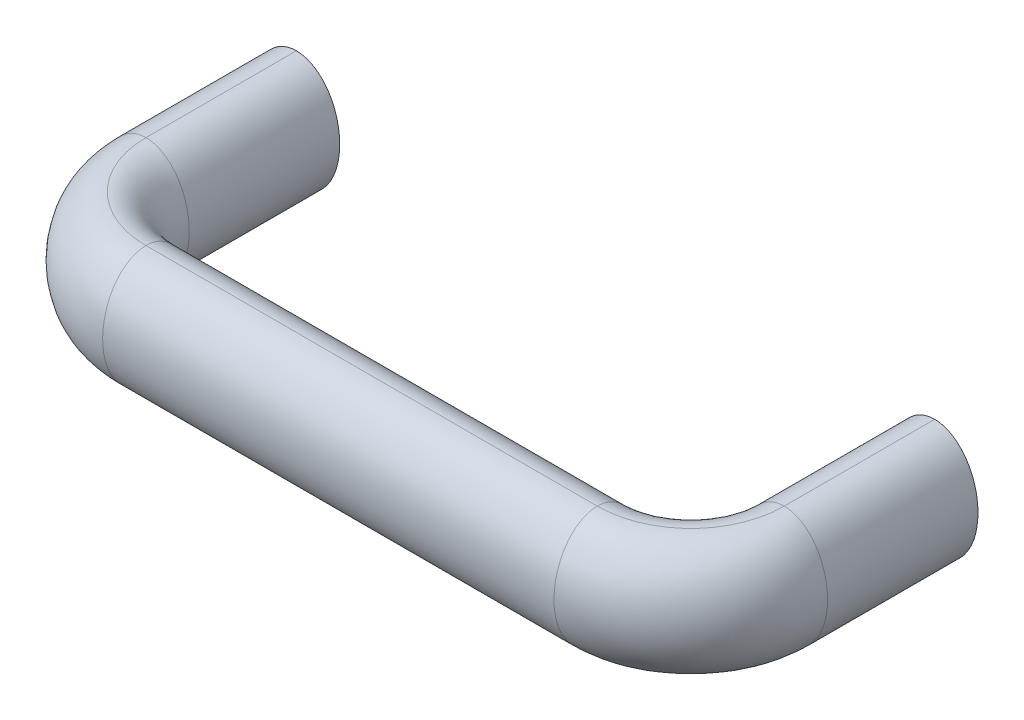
ISO-10303-21;
HEADER;
FILE_DESCRIPTION(('STEP AP214'),'2;1');
FILE_NAME('part.step','',(''),(''),'','','');
FILE_SCHEMA(('AUTOMOTIVE_DESIGN { 1 0 10303 214 1 1 1 1 }'));
ENDSEC;
DATA;
#1=APPLICATION_CONTEXT('core data for automotive mechanical design processes');
#2=APPLICATION_PROTOCOL_DEFINITION('international standard','automotive_design',2000,#1);
#3=PRODUCT_CONTEXT('',#1,'mechanical');
#4=PRODUCT('Part','Part','',(#3));
#5=PRODUCT_RELATED_PRODUCT_CATEGORY('part','',(#4));
#6=PRODUCT_DEFINITION_FORMATION('','',#4);
#7=PRODUCT_DEFINITION_CONTEXT('part definition',#1,'design');
#8=PRODUCT_DEFINITION('design','',#6,#7);
#9=PRODUCT_DEFINITION_SHAPE('','',#8);
#10=(LENGTH_UNIT() NAMED_UNIT(*) SI_UNIT(.MILLI.,.METRE.));
#11=(NAMED_UNIT(*) PLANE_ANGLE_UNIT() SI_UNIT($,.RADIAN.));
#12=(NAMED_UNIT(*) SI_UNIT($,.STERADIAN.) SOLID_ANGLE_UNIT());
#13=UNCERTAINTY_MEASURE_WITH_UNIT(LENGTH_MEASURE(1.E-05),#10,'distance_accuracy_value','');
#14=(GEOMETRIC_REPRESENTATION_CONTEXT(3) GLOBAL_UNCERTAINTY_ASSIGNED_CONTEXT((#13)) GLOBAL_UNIT_ASSIGNED_CONTEXT((#10,
#11,#12)) REPRESENTATION_CONTEXT('',''));
#15=CARTESIAN_POINT('',(0.,0.,0.));
#16=DIRECTION('',(0.,0.,1.));
#17=DIRECTION('',(1.,0.,0.));
#18=AXIS2_PLACEMENT_3D('',#15,#16,#17);
#19=CARTESIAN_POINT('',(0.,0.,0.));
#20=DIRECTION('',(0.,0.,-1.));
#21=DIRECTION('',(0.,1.,0.));
#22=AXIS2_PLACEMENT_3D('',#19,#20,#21);
#23=CONICAL_SURFACE('',#22,3.24999999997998,0.785398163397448);
#24=CARTESIAN_POINT('',(0.,0.,0.249999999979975));
#25=DIRECTION('',(0.,0.,-1.));
#26=DIRECTION('',(0.,1.,0.));
#27=AXIS2_PLACEMENT_3D('',#24,#25,#26);
#28=CIRCLE('',#27,3.);
#29=CARTESIAN_POINT('',(0.,3.,0.249999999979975));
#30=VERTEX_POINT('',#29);
#31=EDGE_CURVE('E316',#30,#30,#28,.F.);
#32=ORIENTED_EDGE('',*,*,#31,.T.);
#33=EDGE_LOOP('',(#32));
#34=FACE_BOUND('',#33,.T.);
#35=CARTESIAN_POINT('',(0.,0.,0.));
#36=DIRECTION('',(0.,0.,-1.));
#37=DIRECTION('',(0.,1.,0.));
#38=AXIS2_PLACEMENT_3D('',#35,#36,#37);
#39=CIRCLE('',#38,3.24999999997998);
#40=CARTESIAN_POINT('',(0.,3.24999999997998,0.));
#41=VERTEX_POINT('',#40);
#42=EDGE_CURVE('E72',#41,#41,#39,.T.);
#43=ORIENTED_EDGE('',*,*,#42,.T.);
#44=EDGE_LOOP('',(#43));
#45=FACE_BOUND('',#44,.T.);
#46=ADVANCED_FACE('F14',(#34,#45),#23,.F.);
#47=CARTESIAN_POINT('',(140.,0.,0.));
#48=DIRECTION('',(0.,0.,-1.));
#49=DIRECTION('',(0.,1.,0.));
#50=AXIS2_PLACEMENT_3D('',#47,#48,#49);
#51=CONICAL_SURFACE('',#50,3.24999999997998,0.785398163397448);
#52=CARTESIAN_POINT('',(140.,0.,0.249999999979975));
#53=DIRECTION('',(0.,0.,-1.));
#54=DIRECTION('',(0.,1.,0.));
#55=AXIS2_PLACEMENT_3D('',#52,#53,#54);
#56=CIRCLE('',#55,3.);
#57=CARTESIAN_POINT('',(140.,3.,0.249999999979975));
#58=VERTEX_POINT('',#57);
#59=EDGE_CURVE('E17',#58,#58,#56,.F.);
#60=ORIENTED_EDGE('',*,*,#59,.T.);
#61=EDGE_LOOP('',(#60));
#62=FACE_BOUND('',#61,.T.);
#63=CARTESIAN_POINT('',(140.,0.,0.));
#64=DIRECTION('',(0.,0.,-1.));
#65=DIRECTION('',(0.,1.,0.));
#66=AXIS2_PLACEMENT_3D('',#63,#64,#65);
#67=CIRCLE('',#66,3.24999999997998);
#68=CARTESIAN_POINT('',(140.,3.24999999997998,0.));
#69=VERTEX_POINT('',#68);
#70=EDGE_CURVE('E82',#69,#69,#67,.T.);
#71=ORIENTED_EDGE('',*,*,#70,.T.);
#72=EDGE_LOOP('',(#71));
#73=FACE_BOUND('',#72,.T.);
#74=ADVANCED_FACE('F155',(#62,#73),#51,.F.);
#75=CARTESIAN_POINT('',(0.,0.,0.));
#76=DIRECTION('',(0.,0.,1.));
#77=DIRECTION('',(0.,-1.,0.));
#78=AXIS2_PLACEMENT_3D('',#75,#76,#77);
#79=PLANE('',#78);
#80=ORIENTED_EDGE('',*,*,#42,.F.);
#81=EDGE_LOOP('',(#80));
#82=FACE_BOUND('',#81,.T.);
#83=CARTESIAN_POINT('',(0.,-13.,0.));
#84=CARTESIAN_POINT('',(-0.103704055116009,-13.0000016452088,0.));
#85=CARTESIAN_POINT('',(-0.207393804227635,-12.9976756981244,0.));
#86=CARTESIAN_POINT('',(-0.41456074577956,-12.9883904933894,0.));
#87=CARTESIAN_POINT('',(-0.518037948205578,-12.9814314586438,0.));
#88=CARTESIAN_POINT('',(-0.827720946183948,-12.9536523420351,0.));
#89=CARTESIAN_POINT('',(-1.03334827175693,-12.9259301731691,0.));
#90=CARTESIAN_POINT('',(-1.4398928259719,-12.8528518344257,0.));
#91=CARTESIAN_POINT('',(-1.64083313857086,-12.8076223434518,0.));
#92=CARTESIAN_POINT('',(-2.0381766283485,-12.7003072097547,0.));
#93=CARTESIAN_POINT('',(-2.23457932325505,-12.6382197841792,0.));
#94=CARTESIAN_POINT('',(-2.62116017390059,-12.4983673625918,0.));
#95=CARTESIAN_POINT('',(-2.8113522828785,-12.4206407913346,0.));
#96=CARTESIAN_POINT('',(-3.18513247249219,-12.2505210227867,0.));
#97=CARTESIAN_POINT('',(-3.36871782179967,-12.1581218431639,0.));
#98=CARTESIAN_POINT('',(-3.72876819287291,-11.9597195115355,0.));
#99=CARTESIAN_POINT('',(-3.90522073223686,-11.8536937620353,0.));
#100=CARTESIAN_POINT('',(-4.25016251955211,-11.6293733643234,0.));
#101=CARTESIAN_POINT('',(-4.41865007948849,-11.5110761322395,0.));
#102=CARTESIAN_POINT('',(-4.81454938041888,-11.2127044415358,0.));
#103=CARTESIAN_POINT('',(-5.03785689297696,-11.0271606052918,0.));
#104=CARTESIAN_POINT('',(-5.4673476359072,-10.6371825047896,0.));
#105=CARTESIAN_POINT('',(-5.6735241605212,-10.4327409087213,0.));
#106=CARTESIAN_POINT('',(-6.06866713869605,-10.0076838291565,0.));
#107=CARTESIAN_POINT('',(-6.25762379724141,-9.78705926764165,0.));
#108=CARTESIAN_POINT('',(-6.61826082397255,-9.33226558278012,0.));
#109=CARTESIAN_POINT('',(-6.78994500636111,-9.09809946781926,0.));
#110=CARTESIAN_POINT('',(-7.16996529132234,-8.5395199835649,0.));
#111=CARTESIAN_POINT('',(-7.37184591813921,-8.2107037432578,0.));
#112=CARTESIAN_POINT('',(-7.74637926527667,-7.53739509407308,0.));
#113=CARTESIAN_POINT('',(-7.91906165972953,-7.19291905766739,0.));
#114=CARTESIAN_POINT('',(-8.23777473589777,-6.48832470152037,0.));
#115=CARTESIAN_POINT('',(-8.38356346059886,-6.12809734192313,0.));
#116=CARTESIAN_POINT('',(-8.64757633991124,-5.39757283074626,0.));
#117=CARTESIAN_POINT('',(-8.76578993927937,-5.02727188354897,0.));
#118=CARTESIAN_POINT('',(-8.97563498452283,-4.27817663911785,0.));
#119=CARTESIAN_POINT('',(-9.06719481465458,-3.89936235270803,0.));
#120=CARTESIAN_POINT('',(-9.22392372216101,-3.13636922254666,0.));
#121=CARTESIAN_POINT('',(-9.28909437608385,-2.75219070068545,0.));
#122=CARTESIAN_POINT('',(-9.40169645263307,-1.91979237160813,0.));
#123=CARTESIAN_POINT('',(-9.44474471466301,-1.47097543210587,0.));
#124=CARTESIAN_POINT('',(-9.49655008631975,-0.571299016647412,0.));
#125=CARTESIAN_POINT('',(-9.50530008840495,-0.120439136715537,0.));
#126=CARTESIAN_POINT('',(-9.48859034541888,0.77973788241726,0.));
#127=CARTESIAN_POINT('',(-9.46320011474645,1.22905629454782,0.));
#128=CARTESIAN_POINT('',(-9.37811003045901,2.12428232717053,0.));
#129=CARTESIAN_POINT('',(-9.31842213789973,2.57019108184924,0.));
#130=CARTESIAN_POINT('',(-9.15762533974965,3.4937015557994,0.));
#131=CARTESIAN_POINT('',(-9.05342310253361,3.97077013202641,0.));
#132=CARTESIAN_POINT('',(-8.80270918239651,4.91433412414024,0.));
#133=CARTESIAN_POINT('',(-8.65615012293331,5.38081706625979,0.));
#134=CARTESIAN_POINT('',(-8.35114563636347,6.21100389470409,0.));
#135=CARTESIAN_POINT('',(-8.20018770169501,6.57746351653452,0.));
#136=CARTESIAN_POINT('',(-7.86847223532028,7.29687971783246,0.));
#137=CARTESIAN_POINT('',(-7.68770410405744,7.64983143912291,0.));
#138=CARTESIAN_POINT('',(-7.29558770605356,8.3379282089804,0.));
#139=CARTESIAN_POINT('',(-7.08427388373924,8.67309274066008,0.));
#140=CARTESIAN_POINT('',(-6.63011203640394,9.32128606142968,0.));
#141=CARTESIAN_POINT('',(-6.3872666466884,9.63431669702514,0.));
#142=CARTESIAN_POINT('',(-5.79567080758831,10.3176696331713,0.));
#143=CARTESIAN_POINT('',(-5.43639726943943,10.6791397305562,0.));
#144=CARTESIAN_POINT('',(-4.85877738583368,11.1754034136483,0.));
#145=CARTESIAN_POINT('',(-4.65983803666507,11.3331354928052,0.));
#146=CARTESIAN_POINT('',(-4.24934295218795,11.6313384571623,0.));
#147=CARTESIAN_POINT('',(-4.03778925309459,11.7718121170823,0.));
#148=CARTESIAN_POINT('',(-3.6372783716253,12.0125400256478,0.));
#149=CARTESIAN_POINT('',(-3.45002924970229,12.1156424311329,0.));
#150=CARTESIAN_POINT('',(-3.06792288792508,12.3066022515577,0.));
#151=CARTESIAN_POINT('',(-2.87306710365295,12.3944625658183,0.));
#152=CARTESIAN_POINT('',(-2.47696779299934,12.5535130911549,0.));
#153=CARTESIAN_POINT('',(-2.27573388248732,12.6247271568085,0.));
#154=CARTESIAN_POINT('',(-1.86792463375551,12.7494337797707,0.));
#155=CARTESIAN_POINT('',(-1.66135116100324,12.8029324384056,0.));
#156=CARTESIAN_POINT('',(-1.2142278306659,12.8976013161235,0.));
#157=CARTESIAN_POINT('',(-0.9730556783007,12.9359012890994,0.));
#158=CARTESIAN_POINT('',(-0.609314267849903,12.9743043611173,0.));
#159=CARTESIAN_POINT('',(-0.487680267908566,12.9839309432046,0.));
#160=CARTESIAN_POINT('',(-0.244039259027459,12.9967810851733,0.));
#161=CARTESIAN_POINT('',(-0.122032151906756,13.0000027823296,0.));
#162=CARTESIAN_POINT('',(0.,13.,0.));
#163=B_SPLINE_CURVE_WITH_KNOTS('',3,(#83,#84,#85,#86,#87,#88,#89,#90,#91,#92,#93,#94,#95,#96,
#97,#98,#99,#100,#101,#102,#103,#104,#105,#106,#107,#108,#109,#110,#111,#112,#113,#114,#115,
#116,#117,#118,#119,#120,#121,#122,#123,#124,#125,#126,#127,#128,#129,#130,#131,#132,#133,#134,
#135,#136,#137,#138,#139,#140,#141,#142,#143,#144,#145,#146,#147,#148,#149,#150,#151,#152,#153,
#154,#155,#156,#157,#158,#159,#160,#161,#162),.UNSPECIFIED.,.F.,.F.,(4,2,2,2,2,2,2,2,2,2,2,2,2,
2,2,2,2,2,2,2,2,2,2,2,2,2,2,2,2,2,2,2,2,2,2,2,2,2,2,4),(0.,0.311057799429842,0.622100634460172,
1.24367772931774,1.8608388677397,2.47806530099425,3.09379335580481,3.70977310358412,
4.32678786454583,4.94393280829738,5.81364209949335,6.68369024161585,7.55423023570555,
8.4245775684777,9.58047710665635,10.735194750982,11.8998422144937,13.0649347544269,
14.2331294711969,15.4012543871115,16.7525213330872,18.1040682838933,19.4528674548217,
20.8011965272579,22.2642970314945,23.7290404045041,24.9168225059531,26.1050278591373,
27.2919036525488,28.47868031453,30.0012695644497,30.76220027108,31.5230084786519,
32.163659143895,32.8041878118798,33.4437928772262,34.0831774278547,34.8143011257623,
35.1801993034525,35.5462038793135),.UNSPECIFIED.);
#164=CARTESIAN_POINT('',(0.,-13.,0.));
#165=VERTEX_POINT('',#164);
#166=CARTESIAN_POINT('',(0.,13.,0.));
#167=VERTEX_POINT('',#166);
#168=EDGE_CURVE('E64',#165,#167,#163,.T.);
#169=ORIENTED_EDGE('',*,*,#168,.T.);
#170=CARTESIAN_POINT('',(0.,13.,0.));
#171=CARTESIAN_POINT('',(0.10370405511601,13.0000016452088,0.));
#172=CARTESIAN_POINT('',(0.207393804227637,12.9976756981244,0.));
#173=CARTESIAN_POINT('',(0.414560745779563,12.9883904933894,0.));
#174=CARTESIAN_POINT('',(0.518037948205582,12.9814314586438,0.));
#175=CARTESIAN_POINT('',(0.827720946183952,12.9536523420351,0.));
#176=CARTESIAN_POINT('',(1.03334827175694,12.9259301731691,0.));
#177=CARTESIAN_POINT('',(1.4398928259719,12.8528518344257,0.));
#178=CARTESIAN_POINT('',(1.64083313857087,12.8076223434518,0.));
#179=CARTESIAN_POINT('',(2.03817662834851,12.7003072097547,0.));
#180=CARTESIAN_POINT('',(2.23457932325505,12.6382197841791,0.));
#181=CARTESIAN_POINT('',(2.62116017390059,12.4983673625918,0.));
#182=CARTESIAN_POINT('',(2.8113522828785,12.4206407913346,0.));
#183=CARTESIAN_POINT('',(3.1851324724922,12.2505210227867,0.));
#184=CARTESIAN_POINT('',(3.36871782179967,12.1581218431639,0.));
#185=CARTESIAN_POINT('',(3.72876819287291,11.9597195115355,0.));
#186=CARTESIAN_POINT('',(3.90522073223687,11.8536937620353,0.));
#187=CARTESIAN_POINT('',(4.25016251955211,11.6293733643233,0.));
#188=CARTESIAN_POINT('',(4.41865007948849,11.5110761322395,0.));
#189=CARTESIAN_POINT('',(4.81454938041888,11.2127044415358,0.));
#190=CARTESIAN_POINT('',(5.03785689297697,11.0271606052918,0.));
#191=CARTESIAN_POINT('',(5.46734763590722,10.6371825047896,0.));
#192=CARTESIAN_POINT('',(5.67352416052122,10.4327409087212,0.));
#193=CARTESIAN_POINT('',(6.06866713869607,10.0076838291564,0.));
#194=CARTESIAN_POINT('',(6.25762379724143,9.78705926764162,0.));
#195=CARTESIAN_POINT('',(6.61826082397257,9.33226558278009,0.));
#196=CARTESIAN_POINT('',(6.78994500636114,9.09809946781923,0.));
#197=CARTESIAN_POINT('',(7.16996529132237,8.53951998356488,0.));
#198=CARTESIAN_POINT('',(7.37184591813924,8.21070374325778,0.));
#199=CARTESIAN_POINT('',(7.74637926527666,7.53739509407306,0.));
#200=CARTESIAN_POINT('',(7.9190616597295,7.19291905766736,0.));
#201=CARTESIAN_POINT('',(8.23777473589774,6.48832470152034,0.));
#202=CARTESIAN_POINT('',(8.38356346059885,6.12809734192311,0.));
#203=CARTESIAN_POINT('',(8.64757633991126,5.39757283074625,0.));
#204=CARTESIAN_POINT('',(8.76578993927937,5.02727188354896,0.));
#205=CARTESIAN_POINT('',(8.97563498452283,4.27817663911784,0.));
#206=CARTESIAN_POINT('',(9.06719481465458,3.89936235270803,0.));
#207=CARTESIAN_POINT('',(9.223923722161,3.13636922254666,0.));
#208=CARTESIAN_POINT('',(9.28909437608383,2.75219070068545,0.));
#209=CARTESIAN_POINT('',(9.40169645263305,1.91979237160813,0.));
#210=CARTESIAN_POINT('',(9.444744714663,1.47097543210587,0.));
#211=CARTESIAN_POINT('',(9.49655008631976,0.571299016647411,0.));
#212=CARTESIAN_POINT('',(9.50530008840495,0.120439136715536,0.));
#213=CARTESIAN_POINT('',(9.48859034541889,-0.779737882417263,0.));
#214=CARTESIAN_POINT('',(9.46320011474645,-1.22905629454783,0.));
#215=CARTESIAN_POINT('',(9.378110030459,-2.12428232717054,0.));
#216=CARTESIAN_POINT('',(9.31842213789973,-2.57019108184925,0.));
#217=CARTESIAN_POINT('',(9.15762533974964,-3.49370155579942,0.));
#218=CARTESIAN_POINT('',(9.05342310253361,-3.97077013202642,0.));
#219=CARTESIAN_POINT('',(8.80270918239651,-4.91433412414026,0.));
#220=CARTESIAN_POINT('',(8.65615012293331,-5.38081706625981,0.));
#221=CARTESIAN_POINT('',(8.35114563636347,-6.21100389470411,0.));
#222=CARTESIAN_POINT('',(8.20018770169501,-6.57746351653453,0.));
#223=CARTESIAN_POINT('',(7.86847223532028,-7.29687971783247,0.));
#224=CARTESIAN_POINT('',(7.68770410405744,-7.64983143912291,0.));
#225=CARTESIAN_POINT('',(7.29558770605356,-8.33792820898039,0.));
#226=CARTESIAN_POINT('',(7.08427388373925,-8.67309274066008,0.));
#227=CARTESIAN_POINT('',(6.63011203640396,-9.32128606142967,0.));
#228=CARTESIAN_POINT('',(6.38726664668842,-9.63431669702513,0.));
#229=CARTESIAN_POINT('',(5.79567080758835,-10.3176696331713,0.));
#230=CARTESIAN_POINT('',(5.43639726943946,-10.6791397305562,0.));
#231=CARTESIAN_POINT('',(4.8587773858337,-11.1754034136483,0.));
#232=CARTESIAN_POINT('',(4.65983803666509,-11.3331354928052,0.));
#233=CARTESIAN_POINT('',(4.24934295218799,-11.6313384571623,0.));
#234=CARTESIAN_POINT('',(4.03778925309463,-11.7718121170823,0.));
#235=CARTESIAN_POINT('',(3.63727837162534,-12.0125400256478,0.));
#236=CARTESIAN_POINT('',(3.45002924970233,-12.1156424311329,0.));
#237=CARTESIAN_POINT('',(3.06792288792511,-12.3066022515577,0.));
#238=CARTESIAN_POINT('',(2.87306710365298,-12.3944625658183,0.));
#239=CARTESIAN_POINT('',(2.47696779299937,-12.5535130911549,0.));
#240=CARTESIAN_POINT('',(2.27573388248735,-12.6247271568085,0.));
#241=CARTESIAN_POINT('',(1.86792463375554,-12.7494337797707,0.));
#242=CARTESIAN_POINT('',(1.66135116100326,-12.8029324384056,0.));
#243=CARTESIAN_POINT('',(1.21422783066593,-12.8976013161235,0.));
#244=CARTESIAN_POINT('',(0.973055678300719,-12.9359012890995,0.));
#245=CARTESIAN_POINT('',(0.609314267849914,-12.9743043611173,0.));
#246=CARTESIAN_POINT('',(0.487680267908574,-12.9839309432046,0.));
#247=CARTESIAN_POINT('',(0.244039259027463,-12.9967810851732,0.));
#248=CARTESIAN_POINT('',(0.122032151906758,-13.0000027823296,0.));
#249=CARTESIAN_POINT('',(0.,-13.,0.));
#250=B_SPLINE_CURVE_WITH_KNOTS('',3,(#170,#171,#172,#173,#174,#175,#176,#177,#178,#179,#180,
#181,#182,#183,#184,#185,#186,#187,#188,#189,#190,#191,#192,#193,#194,#195,#196,#197,#198,#199,
#200,#201,#202,#203,#204,#205,#206,#207,#208,#209,#210,#211,#212,#213,#214,#215,#216,#217,#218,
#219,#220,#221,#222,#223,#224,#225,#226,#227,#228,#229,#230,#231,#232,#233,#234,#235,#236,#237,
#238,#239,#240,#241,#242,#243,#244,#245,#246,#247,#248,#249),.UNSPECIFIED.,.F.,.F.,(4,2,2,2,2,2,
2,2,2,2,2,2,2,2,2,2,2,2,2,2,2,2,2,2,2,2,2,2,2,2,2,2,2,2,2,2,2,2,2,4),(0.,0.311057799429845,
0.622100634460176,1.24367772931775,1.8608388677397,2.47806530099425,3.09379335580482,
3.70977310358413,4.32678786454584,4.94393280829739,5.81364209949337,6.68369024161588,
7.55423023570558,8.42457756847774,9.58047710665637,10.735194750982,11.8998422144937,
13.0649347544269,14.2331294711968,15.4012543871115,16.7525213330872,18.1040682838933,
19.4528674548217,20.8011965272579,22.2642970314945,23.7290404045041,24.9168225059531,
26.1050278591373,27.2919036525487,28.47868031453,30.0012695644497,30.7622002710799,
31.5230084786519,32.163659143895,32.8041878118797,33.4437928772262,34.0831774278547,
34.8143011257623,35.1801993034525,35.5462038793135),.UNSPECIFIED.);
#251=EDGE_CURVE('E66',#167,#165,#250,.T.);
#252=ORIENTED_EDGE('',*,*,#251,.T.);
#253=EDGE_LOOP('',(#169,#252));
#254=FACE_BOUND('',#253,.T.);
#255=ADVANCED_FACE('F68',(#82,#254),#79,.F.);
#256=CARTESIAN_POINT('',(0.,-13.,33.));
#257=CARTESIAN_POINT('',(0.,-13.,0.));
#258=CARTESIAN_POINT('',(19.,-13.,33.));
#259=CARTESIAN_POINT('',(19.,-13.,0.));
#260=CARTESIAN_POINT('',(19.,13.,33.));
#261=CARTESIAN_POINT('',(19.,13.,0.));
#262=CARTESIAN_POINT('',(0.,13.,33.));
#263=CARTESIAN_POINT('',(0.,13.,0.));
#264=(BOUNDED_SURFACE() B_SPLINE_SURFACE(3,1,((#256,#257),(#258,#259),(#260,#261),(#262,#263)),
.UNSPECIFIED.,.F.,.F.,.F.) B_SPLINE_SURFACE_WITH_KNOTS((4,4),(2,2),(0.,1.),(0.,1.),
.UNSPECIFIED.) GEOMETRIC_REPRESENTATION_ITEM() RATIONAL_B_SPLINE_SURFACE(((1.,1.),
(0.333333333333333,0.333333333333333),(0.333333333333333,0.333333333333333),(1.,1.))) REPRESENTATION_ITEM('') SURFACE());
#265=CARTESIAN_POINT('',(0.,-13.,33.));
#266=CARTESIAN_POINT('',(19.,-13.,33.));
#267=CARTESIAN_POINT('',(19.,13.,33.));
#268=CARTESIAN_POINT('',(0.,13.,33.));
#269=(BOUNDED_CURVE() B_SPLINE_CURVE(3,(#265,#266,#267,#268),.UNSPECIFIED.,.F.,
.F.) B_SPLINE_CURVE_WITH_KNOTS((4,4),(0.,1.),
.UNSPECIFIED.) CURVE() GEOMETRIC_REPRESENTATION_ITEM() RATIONAL_B_SPLINE_CURVE((1.,
0.333333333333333,0.333333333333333,1.)) REPRESENTATION_ITEM(''));
#270=CARTESIAN_POINT('',(0.,-13.,33.));
#271=VERTEX_POINT('',#270);
#272=CARTESIAN_POINT('',(0.,13.,33.));
#273=VERTEX_POINT('',#272);
#274=EDGE_CURVE('E78',#271,#273,#269,.T.);
#275=DIRECTION('',(0.,0.,-1.));
#276=VECTOR('',#275,1.);
#277=CARTESIAN_POINT('',(0.,-13.,16.5));
#278=LINE('',#277,#276);
#279=EDGE_CURVE('E75',#271,#165,#278,.T.);
#280=DIRECTION('',(0.,0.,1.));
#281=VECTOR('',#280,1.);
#282=CARTESIAN_POINT('',(0.,13.,16.5));
#283=LINE('',#282,#281);
#284=EDGE_CURVE('E85',#167,#273,#283,.T.);
#285=ORIENTED_EDGE('',*,*,#274,.F.);
#286=ORIENTED_EDGE('',*,*,#279,.T.);
#287=ORIENTED_EDGE('',*,*,#251,.F.);
#288=ORIENTED_EDGE('',*,*,#284,.T.);
#289=EDGE_LOOP('',(#285,#286,#287,#288));
#290=FACE_BOUND('',#289,.T.);
#291=ADVANCED_FACE('F76',(#290),#264,.F.);
#292=CARTESIAN_POINT('',(140.,-13.,33.));
#293=CARTESIAN_POINT('',(140.,-13.,0.));
#294=CARTESIAN_POINT('',(121.,-13.,33.));
#295=CARTESIAN_POINT('',(121.,-13.,0.));
#296=CARTESIAN_POINT('',(121.,13.,33.));
#297=CARTESIAN_POINT('',(121.,13.,0.));
#298=CARTESIAN_POINT('',(140.,13.,33.));
#299=CARTESIAN_POINT('',(140.,13.,0.));
#300=(BOUNDED_SURFACE() B_SPLINE_SURFACE(3,1,((#292,#293),(#294,#295),(#296,#297),(#298,#299)),
.UNSPECIFIED.,.F.,.F.,.F.) B_SPLINE_SURFACE_WITH_KNOTS((4,4),(2,2),(0.,1.),(0.,1.),
.UNSPECIFIED.) GEOMETRIC_REPRESENTATION_ITEM() RATIONAL_B_SPLINE_SURFACE(((1.,1.),
(0.333333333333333,0.333333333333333),(0.333333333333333,0.333333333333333),(1.,1.))) REPRESENTATION_ITEM('') SURFACE());
#301=CARTESIAN_POINT('',(140.,13.,0.));
#302=CARTESIAN_POINT('',(139.896295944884,13.0000016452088,0.));
#303=CARTESIAN_POINT('',(139.792606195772,12.9976756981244,0.));
#304=CARTESIAN_POINT('',(139.58543925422,12.9883904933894,0.));
#305=CARTESIAN_POINT('',(139.481962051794,12.9814314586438,0.));
#306=CARTESIAN_POINT('',(139.172279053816,12.9536523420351,0.));
#307=CARTESIAN_POINT('',(138.966651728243,12.9259301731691,0.));
#308=CARTESIAN_POINT('',(138.560107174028,12.8528518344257,0.));
#309=CARTESIAN_POINT('',(138.359166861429,12.8076223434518,0.));
#310=CARTESIAN_POINT('',(137.961823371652,12.7003072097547,0.));
#311=CARTESIAN_POINT('',(137.765420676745,12.6382197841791,0.));
#312=CARTESIAN_POINT('',(137.378839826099,12.4983673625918,0.));
#313=CARTESIAN_POINT('',(137.188647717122,12.4206407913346,0.));
#314=CARTESIAN_POINT('',(136.814867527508,12.2505210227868,0.));
#315=CARTESIAN_POINT('',(136.6312821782,12.1581218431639,0.));
#316=CARTESIAN_POINT('',(136.271231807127,11.9597195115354,0.));
#317=CARTESIAN_POINT('',(136.094779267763,11.8536937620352,0.));
#318=CARTESIAN_POINT('',(135.749837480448,11.6293733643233,0.));
#319=CARTESIAN_POINT('',(135.581349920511,11.5110761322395,0.));
#320=CARTESIAN_POINT('',(135.185450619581,11.2127044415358,0.));
#321=CARTESIAN_POINT('',(134.962143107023,11.0271606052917,0.));
#322=CARTESIAN_POINT('',(134.532652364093,10.6371825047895,0.));
#323=CARTESIAN_POINT('',(134.326475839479,10.4327409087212,0.));
#324=CARTESIAN_POINT('',(133.931332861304,10.0076838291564,0.));
#325=CARTESIAN_POINT('',(133.742376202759,9.78705926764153,0.));
#326=CARTESIAN_POINT('',(133.381739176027,9.33226558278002,0.));
#327=CARTESIAN_POINT('',(133.210054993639,9.09809946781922,0.));
#328=CARTESIAN_POINT('',(132.830034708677,8.53951998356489,0.));
#329=CARTESIAN_POINT('',(132.628154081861,8.21070374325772,0.));
#330=CARTESIAN_POINT('',(132.253620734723,7.53739509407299,0.));
#331=CARTESIAN_POINT('',(132.08093834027,7.19291905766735,0.));
#332=CARTESIAN_POINT('',(131.762225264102,6.48832470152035,0.));
#333=CARTESIAN_POINT('',(131.616436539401,6.12809734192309,0.));
#334=CARTESIAN_POINT('',(131.352423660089,5.39757283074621,0.));
#335=CARTESIAN_POINT('',(131.234210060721,5.02727188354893,0.));
#336=CARTESIAN_POINT('',(131.024365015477,4.27817663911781,0.));
#337=CARTESIAN_POINT('',(130.932805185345,3.899362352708,0.));
#338=CARTESIAN_POINT('',(130.776076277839,3.13636922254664,0.));
#339=CARTESIAN_POINT('',(130.710905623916,2.75219070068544,0.));
#340=CARTESIAN_POINT('',(130.598303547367,1.91979237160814,0.));
#341=CARTESIAN_POINT('',(130.555255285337,1.47097543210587,0.));
#342=CARTESIAN_POINT('',(130.50344991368,0.571299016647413,0.));
#343=CARTESIAN_POINT('',(130.494699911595,0.120439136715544,0.));
#344=CARTESIAN_POINT('',(130.511409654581,-0.779737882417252,0.));
#345=CARTESIAN_POINT('',(130.536799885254,-1.22905629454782,0.));
#346=CARTESIAN_POINT('',(130.621889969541,-2.12428232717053,0.));
#347=CARTESIAN_POINT('',(130.6815778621,-2.57019108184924,0.));
#348=CARTESIAN_POINT('',(130.84237466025,-3.49370155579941,0.));
#349=CARTESIAN_POINT('',(130.946576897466,-3.97077013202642,0.));
#350=CARTESIAN_POINT('',(131.197290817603,-4.91433412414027,0.));
#351=CARTESIAN_POINT('',(131.343849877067,-5.38081706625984,0.));
#352=CARTESIAN_POINT('',(131.648854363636,-6.21100389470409,0.));
#353=CARTESIAN_POINT('',(131.799812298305,-6.57746351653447,0.));
#354=CARTESIAN_POINT('',(132.13152776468,-7.29687971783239,0.));
#355=CARTESIAN_POINT('',(132.312295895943,-7.64983143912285,0.));
#356=CARTESIAN_POINT('',(132.704412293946,-8.33792820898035,0.));
#357=CARTESIAN_POINT('',(132.915726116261,-8.67309274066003,0.));
#358=CARTESIAN_POINT('',(133.369887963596,-9.32128606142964,0.));
#359=CARTESIAN_POINT('',(133.612733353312,-9.63431669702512,0.));
#360=CARTESIAN_POINT('',(134.204329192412,-10.3176696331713,0.));
#361=CARTESIAN_POINT('',(134.563602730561,-10.6791397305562,0.));
#362=CARTESIAN_POINT('',(135.141222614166,-11.1754034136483,0.));
#363=CARTESIAN_POINT('',(135.340161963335,-11.3331354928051,0.));
#364=CARTESIAN_POINT('',(135.750657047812,-11.6313384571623,0.));
#365=CARTESIAN_POINT('',(135.962210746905,-11.7718121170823,0.));
#366=CARTESIAN_POINT('',(136.362721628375,-12.0125400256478,0.));
#367=CARTESIAN_POINT('',(136.549970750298,-12.1156424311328,0.));
#368=CARTESIAN_POINT('',(136.932077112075,-12.3066022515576,0.));
#369=CARTESIAN_POINT('',(137.126932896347,-12.3944625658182,0.));
#370=CARTESIAN_POINT('',(137.523032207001,-12.5535130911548,0.));
#371=CARTESIAN_POINT('',(137.724266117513,-12.6247271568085,0.));
#372=CARTESIAN_POINT('',(138.132075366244,-12.7494337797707,0.));
#373=CARTESIAN_POINT('',(138.338648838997,-12.8029324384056,0.));
#374=CARTESIAN_POINT('',(138.785772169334,-12.8976013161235,0.));
#375=CARTESIAN_POINT('',(139.026944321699,-12.9359012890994,0.));
#376=CARTESIAN_POINT('',(139.39068573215,-12.9743043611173,0.));
#377=CARTESIAN_POINT('',(139.512319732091,-12.9839309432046,0.));
#378=CARTESIAN_POINT('',(139.755960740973,-12.9967810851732,0.));
#379=CARTESIAN_POINT('',(139.877967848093,-13.0000027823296,0.));
#380=CARTESIAN_POINT('',(140.,-13.,0.));
#381=B_SPLINE_CURVE_WITH_KNOTS('',3,(#301,#302,#303,#304,#305,#306,#307,#308,#309,#310,#311,
#312,#313,#314,#315,#316,#317,#318,#319,#320,#321,#322,#323,#324,#325,#326,#327,#328,#329,#330,
#331,#332,#333,#334,#335,#336,#337,#338,#339,#340,#341,#342,#343,#344,#345,#346,#347,#348,#349,
#350,#351,#352,#353,#354,#355,#356,#357,#358,#359,#360,#361,#362,#363,#364,#365,#366,#367,#368,
#369,#370,#371,#372,#373,#374,#375,#376,#377,#378,#379,#380),.UNSPECIFIED.,.F.,.F.,(4,2,2,2,2,2,
2,2,2,2,2,2,2,2,2,2,2,2,2,2,2,2,2,2,2,2,2,2,2,2,2,2,2,2,2,2,2,2,2,4),(0.,0.311057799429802,
0.62210063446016,1.24367772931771,1.86083886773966,2.47806530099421,3.09379335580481,
3.70977310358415,4.32678786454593,4.9439328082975,5.81364209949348,6.68369024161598,
7.55423023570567,8.42457756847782,9.58047710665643,10.735194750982,11.8998422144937,
13.064934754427,14.2331294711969,15.4012543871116,16.7525213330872,18.1040682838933,
19.4528674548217,20.8011965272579,22.2642970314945,23.7290404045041,24.9168225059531,
26.1050278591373,27.2919036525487,28.47868031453,30.0012695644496,30.7622002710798,
31.5230084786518,32.1636591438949,32.8041878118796,33.4437928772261,34.0831774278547,
34.8143011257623,35.1801993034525,35.5462038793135),.UNSPECIFIED.);
#382=CARTESIAN_POINT('',(140.,13.,0.));
#383=VERTEX_POINT('',#382);
#384=CARTESIAN_POINT('',(140.,-13.,0.));
#385=VERTEX_POINT('',#384);
#386=EDGE_CURVE('E71',#383,#385,#381,.T.);
#387=DIRECTION('',(0.,0.,-1.));
#388=VECTOR('',#387,1.);
#389=CARTESIAN_POINT('',(140.,-13.,16.5));
#390=LINE('',#389,#388);
#391=CARTESIAN_POINT('',(140.,-13.,33.));
#392=VERTEX_POINT('',#391);
#393=EDGE_CURVE('E246',#392,#385,#390,.T.);
#394=CARTESIAN_POINT('',(140.,-13.,33.));
#395=CARTESIAN_POINT('',(121.,-13.,33.));
#396=CARTESIAN_POINT('',(121.,13.,33.));
#397=CARTESIAN_POINT('',(140.,13.,33.));
#398=(BOUNDED_CURVE() B_SPLINE_CURVE(3,(#394,#395,#396,#397),.UNSPECIFIED.,.F.,
.F.) B_SPLINE_CURVE_WITH_KNOTS((4,4),(0.,1.),
.UNSPECIFIED.) CURVE() GEOMETRIC_REPRESENTATION_ITEM() RATIONAL_B_SPLINE_CURVE((1.,
0.333333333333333,0.333333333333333,1.)) REPRESENTATION_ITEM(''));
#399=CARTESIAN_POINT('',(140.,13.,33.));
#400=VERTEX_POINT('',#399);
#401=EDGE_CURVE('E235',#392,#400,#398,.T.);
#402=DIRECTION('',(0.,0.,1.));
#403=VECTOR('',#402,1.);
#404=CARTESIAN_POINT('',(140.,13.,16.5));
#405=LINE('',#404,#403);
#406=EDGE_CURVE('E240',#383,#400,#405,.T.);
#407=ORIENTED_EDGE('',*,*,#386,.T.);
#408=ORIENTED_EDGE('',*,*,#393,.F.);
#409=ORIENTED_EDGE('',*,*,#401,.T.);
#410=ORIENTED_EDGE('',*,*,#406,.F.);
#411=EDGE_LOOP('',(#407,#408,#409,#410));
#412=FACE_BOUND('',#411,.T.);
#413=ADVANCED_FACE('F125',(#412),#300,.T.);
#414=CARTESIAN_POINT('',(140.,0.,0.));
#415=DIRECTION('',(0.,0.,1.));
#416=DIRECTION('',(0.,-1.,0.));
#417=AXIS2_PLACEMENT_3D('',#414,#415,#416);
#418=PLANE('',#417);
#419=ORIENTED_EDGE('',*,*,#70,.F.);
#420=EDGE_LOOP('',(#419));
#421=FACE_BOUND('',#420,.T.);
#422=CARTESIAN_POINT('',(140.,-13.,0.));
#423=CARTESIAN_POINT('',(140.103704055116,-13.0000016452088,0.));
#424=CARTESIAN_POINT('',(140.207393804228,-12.9976756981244,0.));
#425=CARTESIAN_POINT('',(140.41456074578,-12.9883904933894,0.));
#426=CARTESIAN_POINT('',(140.518037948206,-12.9814314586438,0.));
#427=CARTESIAN_POINT('',(140.827720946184,-12.9536523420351,0.));
#428=CARTESIAN_POINT('',(141.033348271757,-12.9259301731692,0.));
#429=CARTESIAN_POINT('',(141.439892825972,-12.8528518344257,0.));
#430=CARTESIAN_POINT('',(141.640833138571,-12.8076223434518,0.));
#431=CARTESIAN_POINT('',(142.038176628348,-12.7003072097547,0.));
#432=CARTESIAN_POINT('',(142.234579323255,-12.6382197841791,0.));
#433=CARTESIAN_POINT('',(142.621160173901,-12.4983673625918,0.));
#434=CARTESIAN_POINT('',(142.811352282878,-12.4206407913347,0.));
#435=CARTESIAN_POINT('',(143.185132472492,-12.2505210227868,0.));
#436=CARTESIAN_POINT('',(143.3687178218,-12.158121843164,0.));
#437=CARTESIAN_POINT('',(143.728768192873,-11.9597195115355,0.));
#438=CARTESIAN_POINT('',(143.905220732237,-11.8536937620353,0.));
#439=CARTESIAN_POINT('',(144.250162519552,-11.6293733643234,0.));
#440=CARTESIAN_POINT('',(144.418650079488,-11.5110761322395,0.));
#441=CARTESIAN_POINT('',(144.814549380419,-11.2127044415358,0.));
#442=CARTESIAN_POINT('',(145.037856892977,-11.0271606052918,0.));
#443=CARTESIAN_POINT('',(145.467347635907,-10.6371825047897,0.));
#444=CARTESIAN_POINT('',(145.673524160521,-10.4327409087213,0.));
#445=CARTESIAN_POINT('',(146.068667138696,-10.0076838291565,0.));
#446=CARTESIAN_POINT('',(146.257623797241,-9.78705926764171,0.));
#447=CARTESIAN_POINT('',(146.618260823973,-9.33226558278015,0.));
#448=CARTESIAN_POINT('',(146.789945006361,-9.09809946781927,0.));
#449=CARTESIAN_POINT('',(147.169965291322,-8.5395199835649,0.));
#450=CARTESIAN_POINT('',(147.371845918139,-8.21070374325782,0.));
#451=CARTESIAN_POINT('',(147.746379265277,-7.53739509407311,0.));
#452=CARTESIAN_POINT('',(147.91906165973,-7.19291905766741,0.));
#453=CARTESIAN_POINT('',(148.237774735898,-6.48832470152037,0.));
#454=CARTESIAN_POINT('',(148.383563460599,-6.12809734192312,0.));
#455=CARTESIAN_POINT('',(148.647576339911,-5.39757283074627,0.));
#456=CARTESIAN_POINT('',(148.765789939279,-5.02727188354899,0.));
#457=CARTESIAN_POINT('',(148.975634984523,-4.27817663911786,0.));
#458=CARTESIAN_POINT('',(149.067194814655,-3.89936235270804,0.));
#459=CARTESIAN_POINT('',(149.223923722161,-3.13636922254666,0.));
#460=CARTESIAN_POINT('',(149.289094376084,-2.75219070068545,0.));
#461=CARTESIAN_POINT('',(149.401696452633,-1.91979237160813,0.));
#462=CARTESIAN_POINT('',(149.444744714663,-1.47097543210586,0.));
#463=CARTESIAN_POINT('',(149.49655008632,-0.571299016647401,0.));
#464=CARTESIAN_POINT('',(149.505300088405,-0.120439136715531,0.));
#465=CARTESIAN_POINT('',(149.488590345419,0.779737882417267,0.));
#466=CARTESIAN_POINT('',(149.463200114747,1.22905629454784,0.));
#467=CARTESIAN_POINT('',(149.378110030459,2.12428232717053,0.));
#468=CARTESIAN_POINT('',(149.3184221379,2.57019108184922,0.));
#469=CARTESIAN_POINT('',(149.15762533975,3.49370155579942,0.));
#470=CARTESIAN_POINT('',(149.053423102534,3.97077013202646,0.));
#471=CARTESIAN_POINT('',(148.802709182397,4.91433412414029,0.));
#472=CARTESIAN_POINT('',(148.656150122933,5.38081706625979,0.));
#473=CARTESIAN_POINT('',(148.351145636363,6.2110038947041,0.));
#474=CARTESIAN_POINT('',(148.200187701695,6.57746351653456,0.));
#475=CARTESIAN_POINT('',(147.86847223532,7.29687971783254,0.));
#476=CARTESIAN_POINT('',(147.687704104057,7.64983143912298,0.));
#477=CARTESIAN_POINT('',(147.295587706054,8.33792820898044,0.));
#478=CARTESIAN_POINT('',(147.084273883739,8.67309274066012,0.));
#479=CARTESIAN_POINT('',(146.630112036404,9.3212860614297,0.));
#480=CARTESIAN_POINT('',(146.387266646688,9.63431669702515,0.));
#481=CARTESIAN_POINT('',(145.795670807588,10.3176696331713,0.));
#482=CARTESIAN_POINT('',(145.436397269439,10.6791397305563,0.));
#483=CARTESIAN_POINT('',(144.858777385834,11.1754034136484,0.));
#484=CARTESIAN_POINT('',(144.659838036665,11.3331354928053,0.));
#485=CARTESIAN_POINT('',(144.249342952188,11.6313384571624,0.));
#486=CARTESIAN_POINT('',(144.037789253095,11.7718121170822,0.));
#487=CARTESIAN_POINT('',(143.637278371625,12.0125400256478,0.));
#488=CARTESIAN_POINT('',(143.450029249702,12.1156424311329,0.));
#489=CARTESIAN_POINT('',(143.067922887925,12.3066022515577,0.));
#490=CARTESIAN_POINT('',(142.873067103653,12.3944625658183,0.));
#491=CARTESIAN_POINT('',(142.476967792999,12.5535130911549,0.));
#492=CARTESIAN_POINT('',(142.275733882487,12.6247271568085,0.));
#493=CARTESIAN_POINT('',(141.867924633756,12.7494337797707,0.));
#494=CARTESIAN_POINT('',(141.661351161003,12.8029324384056,0.));
#495=CARTESIAN_POINT('',(141.214227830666,12.8976013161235,0.));
#496=CARTESIAN_POINT('',(140.973055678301,12.9359012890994,0.));
#497=CARTESIAN_POINT('',(140.60931426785,12.9743043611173,0.));
#498=CARTESIAN_POINT('',(140.487680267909,12.9839309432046,0.));
#499=CARTESIAN_POINT('',(140.244039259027,12.9967810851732,0.));
#500=CARTESIAN_POINT('',(140.122032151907,13.0000027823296,0.));
#501=CARTESIAN_POINT('',(140.,13.,0.));
#502=B_SPLINE_CURVE_WITH_KNOTS('',3,(#422,#423,#424,#425,#426,#427,#428,#429,#430,#431,#432,
#433,#434,#435,#436,#437,#438,#439,#440,#441,#442,#443,#444,#445,#446,#447,#448,#449,#450,#451,
#452,#453,#454,#455,#456,#457,#458,#459,#460,#461,#462,#463,#464,#465,#466,#467,#468,#469,#470,
#471,#472,#473,#474,#475,#476,#477,#478,#479,#480,#481,#482,#483,#484,#485,#486,#487,#488,#489,
#490,#491,#492,#493,#494,#495,#496,#497,#498,#499,#500,#501),.UNSPECIFIED.,.F.,.F.,(4,2,2,2,2,2,
2,2,2,2,2,2,2,2,2,2,2,2,2,2,2,2,2,2,2,2,2,2,2,2,2,2,2,2,2,2,2,2,2,4),(0.,0.31105779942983,
0.622100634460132,1.24367772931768,1.86083886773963,2.47806530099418,3.09379335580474,
3.70977310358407,4.32678786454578,4.94393280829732,5.81364209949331,6.68369024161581,
7.5542302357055,8.42457756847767,9.58047710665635,10.735194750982,11.8998422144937,
13.064934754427,14.2331294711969,15.4012543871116,16.7525213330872,18.1040682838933,
19.4528674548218,20.8011965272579,22.2642970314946,23.7290404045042,24.9168225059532,
26.1050278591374,27.2919036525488,28.4786803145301,30.0012695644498,30.76220027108,
31.523008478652,32.1636591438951,32.8041878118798,33.4437928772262,34.0831774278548,
34.8143011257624,35.1801993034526,35.5462038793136),.UNSPECIFIED.);
#503=EDGE_CURVE('E96',#385,#383,#502,.T.);
#504=ORIENTED_EDGE('',*,*,#503,.F.);
#505=ORIENTED_EDGE('',*,*,#386,.F.);
#506=EDGE_LOOP('',(#504,#505));
#507=FACE_BOUND('',#506,.T.);
#508=ADVANCED_FACE('F113',(#421,#507),#418,.F.);
#509=CARTESIAN_POINT('',(0.,13.,33.));
#510=CARTESIAN_POINT('',(0.,13.,0.));
#511=CARTESIAN_POINT('',(-19.,13.,33.));
#512=CARTESIAN_POINT('',(-19.,13.,0.));
#513=CARTESIAN_POINT('',(-19.,-13.,33.));
#514=CARTESIAN_POINT('',(-19.,-13.,0.));
#515=CARTESIAN_POINT('',(0.,-13.,33.));
#516=CARTESIAN_POINT('',(0.,-13.,0.));
#517=(BOUNDED_SURFACE() B_SPLINE_SURFACE(3,1,((#509,#510),(#511,#512),(#513,#514),(#515,#516)),
.UNSPECIFIED.,.F.,.F.,.F.) B_SPLINE_SURFACE_WITH_KNOTS((4,4),(2,2),(0.,1.),(0.,1.),
.UNSPECIFIED.) GEOMETRIC_REPRESENTATION_ITEM() RATIONAL_B_SPLINE_SURFACE(((1.,1.),
(0.333333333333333,0.333333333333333),(0.333333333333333,0.333333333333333),(1.,1.))) REPRESENTATION_ITEM('') SURFACE());
#518=CARTESIAN_POINT('',(0.,13.,33.));
#519=CARTESIAN_POINT('',(-19.,13.,33.0000000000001));
#520=CARTESIAN_POINT('',(-19.,-13.,33.0000000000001));
#521=CARTESIAN_POINT('',(0.,-13.,33.));
#522=(BOUNDED_CURVE() B_SPLINE_CURVE(3,(#518,#519,#520,#521),.UNSPECIFIED.,.F.,
.F.) B_SPLINE_CURVE_WITH_KNOTS((4,4),(0.,1.),
.UNSPECIFIED.) CURVE() GEOMETRIC_REPRESENTATION_ITEM() RATIONAL_B_SPLINE_CURVE((1.,
0.333333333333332,0.333333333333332,1.)) REPRESENTATION_ITEM(''));
#523=EDGE_CURVE('E266',#273,#271,#522,.T.);
#524=ORIENTED_EDGE('',*,*,#284,.F.);
#525=ORIENTED_EDGE('',*,*,#168,.F.);
#526=ORIENTED_EDGE('',*,*,#279,.F.);
#527=ORIENTED_EDGE('',*,*,#523,.F.);
#528=EDGE_LOOP('',(#524,#525,#526,#527));
#529=FACE_BOUND('',#528,.T.);
#530=ADVANCED_FACE('F84',(#529),#517,.F.);
#531=CARTESIAN_POINT('',(0.,-13.,33.));
#532=CARTESIAN_POINT('',(0.,-13.,45.0086219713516));
#533=CARTESIAN_POINT('',(8.49137802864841,-13.,53.5));
#534=CARTESIAN_POINT('',(20.5,-13.,53.5));
#535=CARTESIAN_POINT('',(19.,-13.,33.));
#536=CARTESIAN_POINT('',(19.,-13.,33.8786796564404));
#537=CARTESIAN_POINT('',(19.6213203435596,-13.,34.5));
#538=CARTESIAN_POINT('',(20.5,-13.,34.5));
#539=CARTESIAN_POINT('',(19.,13.,33.));
#540=CARTESIAN_POINT('',(19.,13.,33.8786796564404));
#541=CARTESIAN_POINT('',(19.6213203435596,13.,34.5));
#542=CARTESIAN_POINT('',(20.5,13.,34.5));
#543=CARTESIAN_POINT('',(0.,13.,33.));
#544=CARTESIAN_POINT('',(0.,13.,45.0086219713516));
#545=CARTESIAN_POINT('',(8.49137802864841,13.,53.5));
#546=CARTESIAN_POINT('',(20.5,13.,53.5));
#547=(BOUNDED_SURFACE() B_SPLINE_SURFACE(3,3,((#531,#532,#533,#534),(#535,#536,#537,#538),(#539,
#540,#541,#542),(#543,#544,#545,#546)),.UNSPECIFIED.,.F.,.F.,
.F.) B_SPLINE_SURFACE_WITH_KNOTS((4,4),(4,4),(0.,1.),(0.,1.),
.UNSPECIFIED.) GEOMETRIC_REPRESENTATION_ITEM() RATIONAL_B_SPLINE_SURFACE(((1.,0.804737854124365,
0.804737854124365,1.),(0.333333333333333,0.268245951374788,0.268245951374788,0.333333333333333),
(0.333333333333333,0.268245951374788,0.268245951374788,0.333333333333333),(1.,0.804737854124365,
0.804737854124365,1.))) REPRESENTATION_ITEM('') SURFACE());
#548=CARTESIAN_POINT('',(20.5,-13.,53.5));
#549=CARTESIAN_POINT('',(20.5,-13.,34.4999999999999));
#550=CARTESIAN_POINT('',(20.5,13.,34.4999999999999));
#551=CARTESIAN_POINT('',(20.5,13.,53.5));
#552=(BOUNDED_CURVE() B_SPLINE_CURVE(3,(#548,#549,#550,#551),.UNSPECIFIED.,.F.,
.F.) B_SPLINE_CURVE_WITH_KNOTS((4,4),(0.,1.),
.UNSPECIFIED.) CURVE() GEOMETRIC_REPRESENTATION_ITEM() RATIONAL_B_SPLINE_CURVE((1.,
0.333333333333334,0.333333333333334,1.)) REPRESENTATION_ITEM(''));
#553=CARTESIAN_POINT('',(20.5,-13.,53.5));
#554=VERTEX_POINT('',#553);
#555=CARTESIAN_POINT('',(20.5,13.,53.5));
#556=VERTEX_POINT('',#555);
#557=EDGE_CURVE('E253',#554,#556,#552,.T.);
#558=CARTESIAN_POINT('',(20.5,-13.,33.));
#559=DIRECTION('',(0.,1.,0.));
#560=DIRECTION('',(0.,0.,1.));
#561=AXIS2_PLACEMENT_3D('',#558,#559,#560);
#562=CIRCLE('',#561,20.5);
#563=EDGE_CURVE('E261',#271,#554,#562,.T.);
#564=CARTESIAN_POINT('',(20.5,13.,33.));
#565=DIRECTION('',(0.,-1.,0.));
#566=DIRECTION('',(0.,0.,-1.));
#567=AXIS2_PLACEMENT_3D('',#564,#565,#566);
#568=CIRCLE('',#567,20.5);
#569=EDGE_CURVE('E270',#556,#273,#568,.T.);
#570=ORIENTED_EDGE('',*,*,#557,.F.);
#571=ORIENTED_EDGE('',*,*,#563,.F.);
#572=ORIENTED_EDGE('',*,*,#274,.T.);
#573=ORIENTED_EDGE('',*,*,#569,.F.);
#574=EDGE_LOOP('',(#570,#571,#572,#573));
#575=FACE_BOUND('',#574,.T.);
#576=ADVANCED_FACE('F112',(#575),#547,.T.);
#577=CARTESIAN_POINT('',(140.,-13.,33.));
#578=CARTESIAN_POINT('',(140.,-13.,45.0086219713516));
#579=CARTESIAN_POINT('',(131.508621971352,-13.,53.5));
#580=CARTESIAN_POINT('',(119.5,-13.,53.5));
#581=CARTESIAN_POINT('',(121.,-13.,33.));
#582=CARTESIAN_POINT('',(121.,-13.,33.8786796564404));
#583=CARTESIAN_POINT('',(120.37867965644,-13.,34.5));
#584=CARTESIAN_POINT('',(119.5,-13.,34.5));
#585=CARTESIAN_POINT('',(121.,13.,33.));
#586=CARTESIAN_POINT('',(121.,13.,33.8786796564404));
#587=CARTESIAN_POINT('',(120.37867965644,13.,34.5));
#588=CARTESIAN_POINT('',(119.5,13.,34.5));
#589=CARTESIAN_POINT('',(140.,13.,33.));
#590=CARTESIAN_POINT('',(140.,13.,45.0086219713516));
#591=CARTESIAN_POINT('',(131.508621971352,13.,53.5));
#592=CARTESIAN_POINT('',(119.5,13.,53.5));
#593=(BOUNDED_SURFACE() B_SPLINE_SURFACE(3,3,((#577,#578,#579,#580),(#581,#582,#583,#584),(#585,
#586,#587,#588),(#589,#590,#591,#592)),.UNSPECIFIED.,.F.,.F.,
.F.) B_SPLINE_SURFACE_WITH_KNOTS((4,4),(4,4),(0.,1.),(0.,1.),
.UNSPECIFIED.) GEOMETRIC_REPRESENTATION_ITEM() RATIONAL_B_SPLINE_SURFACE(((1.,0.804737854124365,
0.804737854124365,1.),(0.333333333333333,0.268245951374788,0.268245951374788,0.333333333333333),
(0.333333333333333,0.268245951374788,0.268245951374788,0.333333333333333),(1.,0.804737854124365,
0.804737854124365,1.))) REPRESENTATION_ITEM('') SURFACE());
#594=CARTESIAN_POINT('',(119.5,-13.,33.));
#595=DIRECTION('',(0.,-1.,0.));
#596=DIRECTION('',(0.,0.,-1.));
#597=AXIS2_PLACEMENT_3D('',#594,#595,#596);
#598=CIRCLE('',#597,20.5);
#599=CARTESIAN_POINT('',(119.5,-13.,53.5));
#600=VERTEX_POINT('',#599);
#601=EDGE_CURVE('E32',#392,#600,#598,.T.);
#602=CARTESIAN_POINT('',(119.5,-13.,53.5));
#603=CARTESIAN_POINT('',(119.5,-13.,34.4999999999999));
#604=CARTESIAN_POINT('',(119.5,13.,34.4999999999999));
#605=CARTESIAN_POINT('',(119.5,13.,53.5));
#606=(BOUNDED_CURVE() B_SPLINE_CURVE(3,(#602,#603,#604,#605),.UNSPECIFIED.,.F.,
.F.) B_SPLINE_CURVE_WITH_KNOTS((4,4),(0.,1.),
.UNSPECIFIED.) CURVE() GEOMETRIC_REPRESENTATION_ITEM() RATIONAL_B_SPLINE_CURVE((1.,
0.333333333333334,0.333333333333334,1.)) REPRESENTATION_ITEM(''));
#607=CARTESIAN_POINT('',(119.5,13.,53.5));
#608=VERTEX_POINT('',#607);
#609=EDGE_CURVE('E250',#608,#600,#606,.F.);
#610=CARTESIAN_POINT('',(119.5,13.,33.));
#611=DIRECTION('',(0.,1.,0.));
#612=DIRECTION('',(0.,0.,1.));
#613=AXIS2_PLACEMENT_3D('',#610,#611,#612);
#614=CIRCLE('',#613,20.5);
#615=EDGE_CURVE('E238',#608,#400,#614,.T.);
#616=ORIENTED_EDGE('',*,*,#401,.F.);
#617=ORIENTED_EDGE('',*,*,#601,.T.);
#618=ORIENTED_EDGE('',*,*,#609,.F.);
#619=ORIENTED_EDGE('',*,*,#615,.T.);
#620=EDGE_LOOP('',(#616,#617,#618,#619));
#621=FACE_BOUND('',#620,.T.);
#622=ADVANCED_FACE('F215',(#621),#593,.F.);
#623=CARTESIAN_POINT('',(140.,13.,33.));
#624=CARTESIAN_POINT('',(140.,13.,0.));
#625=CARTESIAN_POINT('',(159.,13.,33.));
#626=CARTESIAN_POINT('',(159.,13.,0.));
#627=CARTESIAN_POINT('',(159.,-13.,33.));
#628=CARTESIAN_POINT('',(159.,-13.,0.));
#629=CARTESIAN_POINT('',(140.,-13.,33.));
#630=CARTESIAN_POINT('',(140.,-13.,0.));
#631=(BOUNDED_SURFACE() B_SPLINE_SURFACE(3,1,((#623,#624),(#625,#626),(#627,#628),(#629,#630)),
.UNSPECIFIED.,.F.,.F.,.F.) B_SPLINE_SURFACE_WITH_KNOTS((4,4),(2,2),(0.,1.),(0.,1.),
.UNSPECIFIED.) GEOMETRIC_REPRESENTATION_ITEM() RATIONAL_B_SPLINE_SURFACE(((1.,1.),
(0.333333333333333,0.333333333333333),(0.333333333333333,0.333333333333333),(1.,1.))) REPRESENTATION_ITEM('') SURFACE());
#632=CARTESIAN_POINT('',(140.,13.,33.));
#633=CARTESIAN_POINT('',(159.000000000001,13.,33.0000000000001));
#634=CARTESIAN_POINT('',(159.000000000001,-13.,33.0000000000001));
#635=CARTESIAN_POINT('',(140.,-13.,33.));
#636=(BOUNDED_CURVE() B_SPLINE_CURVE(3,(#632,#633,#634,#635),.UNSPECIFIED.,.F.,
.F.) B_SPLINE_CURVE_WITH_KNOTS((4,4),(0.,1.),
.UNSPECIFIED.) CURVE() GEOMETRIC_REPRESENTATION_ITEM() RATIONAL_B_SPLINE_CURVE((1.,
0.333333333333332,0.333333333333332,1.)) REPRESENTATION_ITEM(''));
#637=EDGE_CURVE('E244',#400,#392,#636,.T.);
#638=ORIENTED_EDGE('',*,*,#393,.T.);
#639=ORIENTED_EDGE('',*,*,#503,.T.);
#640=ORIENTED_EDGE('',*,*,#406,.T.);
#641=ORIENTED_EDGE('',*,*,#637,.T.);
#642=EDGE_LOOP('',(#638,#639,#640,#641));
#643=FACE_BOUND('',#642,.T.);
#644=ADVANCED_FACE('F204',(#643),#631,.T.);
#645=CARTESIAN_POINT('',(0.,13.,33.));
#646=CARTESIAN_POINT('',(0.,13.,45.0086219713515));
#647=CARTESIAN_POINT('',(8.49137802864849,13.,53.5));
#648=CARTESIAN_POINT('',(20.5,13.,53.5));
#649=CARTESIAN_POINT('',(-19.,13.,33.0000000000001));
#650=CARTESIAN_POINT('',(-19.,13.,56.1385642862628));
#651=CARTESIAN_POINT('',(-2.6385642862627,13.,72.5000000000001));
#652=CARTESIAN_POINT('',(20.5,13.,72.5));
#653=CARTESIAN_POINT('',(-19.,-13.,33.0000000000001));
#654=CARTESIAN_POINT('',(-19.,-13.,56.1385642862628));
#655=CARTESIAN_POINT('',(-2.6385642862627,-13.,72.5000000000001));
#656=CARTESIAN_POINT('',(20.5,-13.,72.5));
#657=CARTESIAN_POINT('',(0.,-13.,33.));
#658=CARTESIAN_POINT('',(0.,-13.,45.0086219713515));
#659=CARTESIAN_POINT('',(8.49137802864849,-13.,53.5));
#660=CARTESIAN_POINT('',(20.5,-13.,53.5));
#661=(BOUNDED_SURFACE() B_SPLINE_SURFACE(3,3,((#645,#646,#647,#648),(#649,#650,#651,#652),(#653,
#654,#655,#656),(#657,#658,#659,#660)),.UNSPECIFIED.,.F.,.F.,
.F.) B_SPLINE_SURFACE_WITH_KNOTS((4,4),(4,4),(0.,1.),(0.,1.),
.UNSPECIFIED.) GEOMETRIC_REPRESENTATION_ITEM() RATIONAL_B_SPLINE_SURFACE(((1.,0.804737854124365,
0.804737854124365,1.),(0.333333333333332,0.268245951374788,0.268245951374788,0.333333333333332),
(0.333333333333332,0.268245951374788,0.268245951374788,0.333333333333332),(1.,0.804737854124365,
0.804737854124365,1.))) REPRESENTATION_ITEM('') SURFACE());
#662=CARTESIAN_POINT('',(20.5,13.,53.5));
#663=CARTESIAN_POINT('',(20.5,13.,72.5));
#664=CARTESIAN_POINT('',(20.5,-13.,72.5));
#665=CARTESIAN_POINT('',(20.5,-13.,53.5));
#666=(BOUNDED_CURVE() B_SPLINE_CURVE(3,(#662,#663,#664,#665),.UNSPECIFIED.,.F.,
.F.) B_SPLINE_CURVE_WITH_KNOTS((4,4),(0.,1.),
.UNSPECIFIED.) CURVE() GEOMETRIC_REPRESENTATION_ITEM() RATIONAL_B_SPLINE_CURVE((1.,
0.333333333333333,0.333333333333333,1.)) REPRESENTATION_ITEM(''));
#667=EDGE_CURVE('E299',#556,#554,#666,.T.);
#668=ORIENTED_EDGE('',*,*,#563,.T.);
#669=ORIENTED_EDGE('',*,*,#667,.F.);
#670=ORIENTED_EDGE('',*,*,#569,.T.);
#671=ORIENTED_EDGE('',*,*,#523,.T.);
#672=EDGE_LOOP('',(#668,#669,#670,#671));
#673=FACE_BOUND('',#672,.T.);
#674=ADVANCED_FACE('F194',(#673),#661,.T.);
#675=CARTESIAN_POINT('',(20.5,-13.,53.5));
#676=CARTESIAN_POINT('',(119.5,-13.,53.5));
#677=CARTESIAN_POINT('',(20.5,-13.,34.4999999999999));
#678=CARTESIAN_POINT('',(119.5,-13.,34.4999999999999));
#679=CARTESIAN_POINT('',(20.5,13.,34.4999999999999));
#680=CARTESIAN_POINT('',(119.5,13.,34.4999999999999));
#681=CARTESIAN_POINT('',(20.5,13.,53.5));
#682=CARTESIAN_POINT('',(119.5,13.,53.5));
#683=(BOUNDED_SURFACE() B_SPLINE_SURFACE(3,1,((#675,#676),(#677,#678),(#679,#680),(#681,#682)),
.UNSPECIFIED.,.F.,.F.,.F.) B_SPLINE_SURFACE_WITH_KNOTS((4,4),(2,2),(0.,1.),(0.,1.),
.UNSPECIFIED.) GEOMETRIC_REPRESENTATION_ITEM() RATIONAL_B_SPLINE_SURFACE(((1.,1.),
(0.333333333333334,0.333333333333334),(0.333333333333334,0.333333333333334),(1.,1.))) REPRESENTATION_ITEM('') SURFACE());
#684=DIRECTION('',(1.,0.,0.));
#685=VECTOR('',#684,1.);
#686=CARTESIAN_POINT('',(70.,-13.,53.5));
#687=LINE('',#686,#685);
#688=EDGE_CURVE('E23',#554,#600,#687,.T.);
#689=DIRECTION('',(-1.,0.,0.));
#690=VECTOR('',#689,1.);
#691=CARTESIAN_POINT('',(70.,13.,53.5));
#692=LINE('',#691,#690);
#693=EDGE_CURVE('E247',#608,#556,#692,.T.);
#694=ORIENTED_EDGE('',*,*,#609,.T.);
#695=ORIENTED_EDGE('',*,*,#688,.F.);
#696=ORIENTED_EDGE('',*,*,#557,.T.);
#697=ORIENTED_EDGE('',*,*,#693,.F.);
#698=EDGE_LOOP('',(#694,#695,#696,#697));
#699=FACE_BOUND('',#698,.T.);
#700=ADVANCED_FACE('F170',(#699),#683,.T.);
#701=CARTESIAN_POINT('',(140.,13.,33.));
#702=CARTESIAN_POINT('',(140.,13.,45.0086219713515));
#703=CARTESIAN_POINT('',(131.508621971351,13.,53.5));
#704=CARTESIAN_POINT('',(119.5,13.,53.5));
#705=CARTESIAN_POINT('',(159.000000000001,13.,33.0000000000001));
#706=CARTESIAN_POINT('',(159.,13.,56.1385642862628));
#707=CARTESIAN_POINT('',(142.638564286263,13.,72.5000000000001));
#708=CARTESIAN_POINT('',(119.5,13.,72.5));
#709=CARTESIAN_POINT('',(159.000000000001,-13.,33.0000000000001));
#710=CARTESIAN_POINT('',(159.,-13.,56.1385642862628));
#711=CARTESIAN_POINT('',(142.638564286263,-13.,72.5000000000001));
#712=CARTESIAN_POINT('',(119.5,-13.,72.5));
#713=CARTESIAN_POINT('',(140.,-13.,33.));
#714=CARTESIAN_POINT('',(140.,-13.,45.0086219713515));
#715=CARTESIAN_POINT('',(131.508621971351,-13.,53.5));
#716=CARTESIAN_POINT('',(119.5,-13.,53.5));
#717=(BOUNDED_SURFACE() B_SPLINE_SURFACE(3,3,((#701,#702,#703,#704),(#705,#706,#707,#708),(#709,
#710,#711,#712),(#713,#714,#715,#716)),.UNSPECIFIED.,.F.,.F.,
.F.) B_SPLINE_SURFACE_WITH_KNOTS((4,4),(4,4),(0.,1.),(0.,1.),
.UNSPECIFIED.) GEOMETRIC_REPRESENTATION_ITEM() RATIONAL_B_SPLINE_SURFACE(((1.,0.804737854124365,
0.804737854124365,1.),(0.333333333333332,0.268245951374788,0.268245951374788,0.333333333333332),
(0.333333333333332,0.268245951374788,0.268245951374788,0.333333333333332),(1.,0.804737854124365,
0.804737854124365,1.))) REPRESENTATION_ITEM('') SURFACE());
#718=CARTESIAN_POINT('',(119.5,13.,53.5));
#719=CARTESIAN_POINT('',(119.5,13.,72.5));
#720=CARTESIAN_POINT('',(119.5,-13.,72.5));
#721=CARTESIAN_POINT('',(119.5,-13.,53.5));
#722=(BOUNDED_CURVE() B_SPLINE_CURVE(3,(#718,#719,#720,#721),.UNSPECIFIED.,.F.,
.F.) B_SPLINE_CURVE_WITH_KNOTS((4,4),(0.,1.),
.UNSPECIFIED.) CURVE() GEOMETRIC_REPRESENTATION_ITEM() RATIONAL_B_SPLINE_CURVE((1.,
0.333333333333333,0.333333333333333,1.)) REPRESENTATION_ITEM(''));
#723=EDGE_CURVE('E9',#600,#608,#722,.F.);
#724=ORIENTED_EDGE('',*,*,#615,.F.);
#725=ORIENTED_EDGE('',*,*,#723,.F.);
#726=ORIENTED_EDGE('',*,*,#601,.F.);
#727=ORIENTED_EDGE('',*,*,#637,.F.);
#728=EDGE_LOOP('',(#724,#725,#726,#727));
#729=FACE_BOUND('',#728,.T.);
#730=ADVANCED_FACE('F160',(#729),#717,.F.);
#731=CARTESIAN_POINT('',(20.5,13.,53.5));
#732=CARTESIAN_POINT('',(119.5,13.,53.5));
#733=CARTESIAN_POINT('',(20.5,13.,72.5));
#734=CARTESIAN_POINT('',(119.5,13.,72.5));
#735=CARTESIAN_POINT('',(20.5,-13.,72.5));
#736=CARTESIAN_POINT('',(119.5,-13.,72.5));
#737=CARTESIAN_POINT('',(20.5,-13.,53.5));
#738=CARTESIAN_POINT('',(119.5,-13.,53.5));
#739=(BOUNDED_SURFACE() B_SPLINE_SURFACE(3,1,((#731,#732),(#733,#734),(#735,#736),(#737,#738)),
.UNSPECIFIED.,.F.,.F.,.F.) B_SPLINE_SURFACE_WITH_KNOTS((4,4),(2,2),(0.,1.),(0.,1.),
.UNSPECIFIED.) GEOMETRIC_REPRESENTATION_ITEM() RATIONAL_B_SPLINE_SURFACE(((1.,1.),
(0.333333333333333,0.333333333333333),(0.333333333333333,0.333333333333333),(1.,1.))) REPRESENTATION_ITEM('') SURFACE());
#740=ORIENTED_EDGE('',*,*,#688,.T.);
#741=ORIENTED_EDGE('',*,*,#723,.T.);
#742=ORIENTED_EDGE('',*,*,#693,.T.);
#743=ORIENTED_EDGE('',*,*,#667,.T.);
#744=EDGE_LOOP('',(#740,#741,#742,#743));
#745=FACE_BOUND('',#744,.T.);
#746=ADVANCED_FACE('F157',(#745),#739,.T.);
#747=CARTESIAN_POINT('',(0.,0.,12.));
#748=DIRECTION('',(0.,0.,-1.));
#749=DIRECTION('',(0.,1.,0.));
#750=AXIS2_PLACEMENT_3D('',#747,#748,#749);
#751=PLANE('',#750);
#752=CARTESIAN_POINT('',(0.,0.,12.));
#753=DIRECTION('',(0.,0.,-1.));
#754=DIRECTION('',(0.,1.,0.));
#755=AXIS2_PLACEMENT_3D('',#752,#753,#754);
#756=CIRCLE('',#755,3.);
#757=CARTESIAN_POINT('',(0.,3.,12.));
#758=VERTEX_POINT('',#757);
#759=EDGE_CURVE('E310',#758,#758,#756,.T.);
#760=ORIENTED_EDGE('',*,*,#759,.T.);
#761=EDGE_LOOP('',(#760));
#762=FACE_BOUND('',#761,.T.);
#763=ADVANCED_FACE('F159',(#762),#751,.T.);
#764=CARTESIAN_POINT('',(0.,0.,12.));
#765=DIRECTION('',(0.,0.,-1.));
#766=DIRECTION('',(0.,1.,0.));
#767=AXIS2_PLACEMENT_3D('',#764,#765,#766);
#768=CYLINDRICAL_SURFACE('',#767,3.);
#769=ORIENTED_EDGE('',*,*,#759,.F.);
#770=EDGE_LOOP('',(#769));
#771=FACE_BOUND('',#770,.T.);
#772=ORIENTED_EDGE('',*,*,#31,.F.);
#773=EDGE_LOOP('',(#772));
#774=FACE_BOUND('',#773,.T.);
#775=ADVANCED_FACE('F167',(#771,#774),#768,.F.);
#776=CARTESIAN_POINT('',(140.,0.,12.));
#777=DIRECTION('',(0.,0.,-1.));
#778=DIRECTION('',(0.,1.,0.));
#779=AXIS2_PLACEMENT_3D('',#776,#777,#778);
#780=PLANE('',#779);
#781=CARTESIAN_POINT('',(140.,0.,12.));
#782=DIRECTION('',(0.,0.,-1.));
#783=DIRECTION('',(0.,1.,0.));
#784=AXIS2_PLACEMENT_3D('',#781,#782,#783);
#785=CIRCLE('',#784,3.);
#786=CARTESIAN_POINT('',(140.,3.,12.));
#787=VERTEX_POINT('',#786);
#788=EDGE_CURVE('E317',#787,#787,#785,.T.);
#789=ORIENTED_EDGE('',*,*,#788,.T.);
#790=EDGE_LOOP('',(#789));
#791=FACE_BOUND('',#790,.T.);
#792=ADVANCED_FACE('F328',(#791),#780,.T.);
#793=CARTESIAN_POINT('',(140.,0.,12.));
#794=DIRECTION('',(0.,0.,-1.));
#795=DIRECTION('',(0.,1.,0.));
#796=AXIS2_PLACEMENT_3D('',#793,#794,#795);
#797=CYLINDRICAL_SURFACE('',#796,3.);
#798=ORIENTED_EDGE('',*,*,#788,.F.);
#799=EDGE_LOOP('',(#798));
#800=FACE_BOUND('',#799,.T.);
#801=ORIENTED_EDGE('',*,*,#59,.F.);
#802=EDGE_LOOP('',(#801));
#803=FACE_BOUND('',#802,.T.);
#804=ADVANCED_FACE('F326',(#800,#803),#797,.F.);
#805=CLOSED_SHELL('',(#46,#74,#255,#291,#413,#508,#530,#576,#622,#644,#674,#700,#730,#746,#763,
#775,#792,#804));
#806=MANIFOLD_SOLID_BREP('B1',#805);
#807=ADVANCED_BREP_SHAPE_REPRESENTATION('',(#18,#806),#14);
#808=SHAPE_DEFINITION_REPRESENTATION(#9,#807);
ENDSEC;
END-ISO-10303-21;
